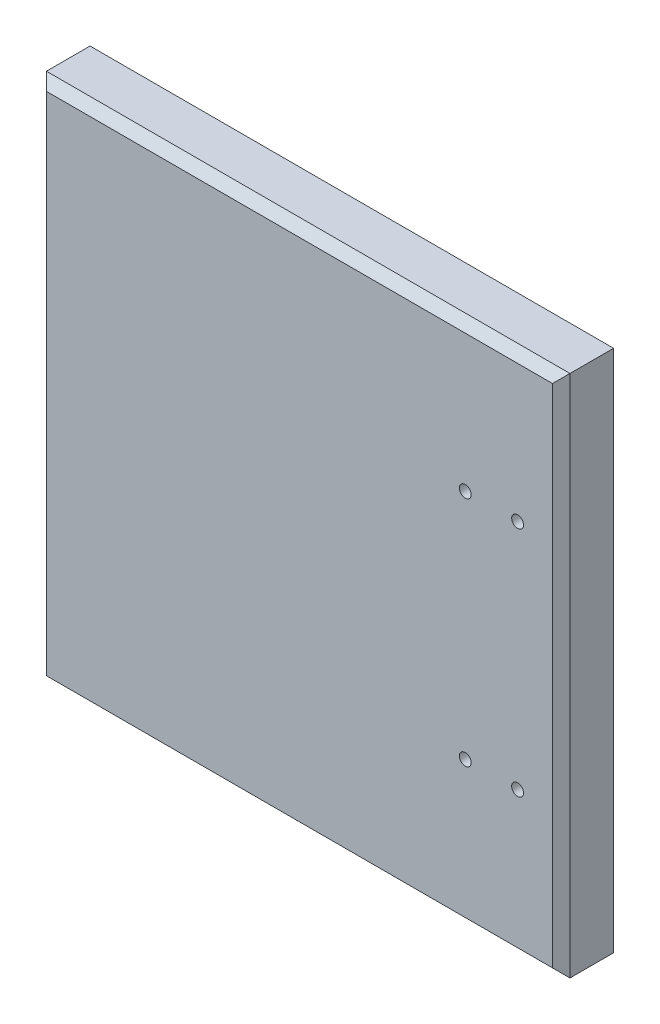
from build123d import *

# Parameters (mm, degrees)
ESQUISSE1_W            = 300
ESQUISSE1_H            = 300
EXTRUSION1_DEPTH       = 30
CHANFREIN1_SIZE        = 5
TROU_TARAUD_M8X1_251_D = 6.8


with BuildPart() as part:
    # Esquisse1 → Extrusion1 (new body)
    with BuildSketch(Plane.XY):
        Rectangle(ESQUISSE1_W, ESQUISSE1_H)
    extrude(amount=EXTRUSION1_DEPTH)

    # Chanfrein1
    chanfrein1_edges = [part.edges().sort_by_distance(p)[0] for p in [
        (150, 0, 30),
        (0, 150, 30),
        (-150, 0, 30),
        (0, -150, 30),
    ]]
    chamfer(chanfrein1_edges, length=CHANFREIN1_SIZE)

    # Trou taraud_ M8x1.251 (through all)
    with Locations(Plane.XY.offset(30)):
        with Locations((125, -66.5), (95, 66.5), (125, 66.5), (95, -66.5)):
            Hole(TROU_TARAUD_M8X1_251_D / 2)


solid = part.part
